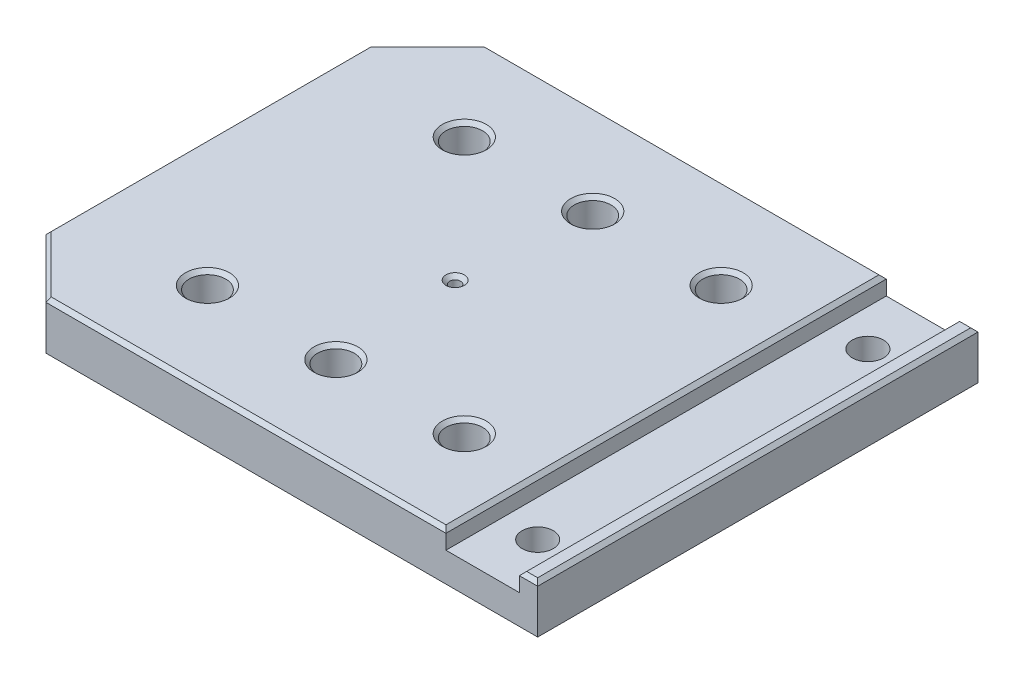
from build123d import *

# Parameters (mm, degrees)
SKETCH1_W           = 150
SKETCH1_H           = 120
BOSS_EXTRUDE1_DEPTH = 14
SKETCH2_W           = 20
SKETCH2_H           = 120
CUT_EXTRUDE1_DEPTH  = 5
SKETCH3_R           = 4.25
CUT_EXTRUDE2_DEPTH  = 163.160414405
CHAMFER1_SIZE       = 16
CUT_EXTRUDE3_DEPTH  = 5
CUT_EXTRUDE4_REACH  = 163.805
SKETCH5_R           = 5
SKETCH7_W           = 85
SKETCH7_H           = 30
CUT_EXTRUDE6_DEPTH  = 3
FILLET1_R           = 5
SKETCH8_R           = 1.5
CUT_EXTRUDE7_DEPTH  = 162.928996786
CHAMFER2_SIZE       = 1


with BuildPart() as part:
    # Sketch1 → Boss-Extrude1 (new body)
    with BuildSketch(Plane(origin=(0, 0, 0), x_dir=(1, 0, 0), z_dir=(0, 1, 0))):
        with Locations((-75, 0)):
            Rectangle(SKETCH1_W, SKETCH1_H)
    extrude(amount=BOSS_EXTRUDE1_DEPTH)

    # Sketch2 → Cut-Extrude1 (cut)
    with BuildSketch(Plane(origin=(0, 14, 0), x_dir=(1, 0, 0), z_dir=(0, 1, 0))):
        with Locations((-15, 0)):
            Rectangle(SKETCH2_W, SKETCH2_H)
    extrude(amount=-CUT_EXTRUDE1_DEPTH, mode=Mode.SUBTRACT)

    # Sketch3 → Cut-Extrude2 (cut, through all)
    with BuildSketch(Plane.XZ):
        with Locations(Location((-15, 45, 0), (0, 0, 270))):
            Circle(SKETCH3_R)
        with Locations(Location((-15, -45, 0), (0, 0, 270))):
            Circle(SKETCH3_R)
    extrude(amount=-CUT_EXTRUDE2_DEPTH, mode=Mode.SUBTRACT)

    # Chamfer1
    chamfer1_edges = [part.edges().sort_by_distance(p)[0] for p in [
        (-150, 7, -60),
        (-150, 7, 60),
    ]]
    chamfer(chamfer1_edges, length=CHAMFER1_SIZE)

    # Sketch4 → Cut-Extrude3 (cut)
    with BuildSketch(Plane.XZ):
        with BuildLine():
            Line((-115, 43), (-45, 43))
            ThreePointArc((-45, 43), (-37, 35), (-45, 27))
            Line((-45, 27), (-115, 27))
            ThreePointArc((-115, 27), (-123, 35), (-115, 43))
        make_face()
    cut_extrude3 = extrude(amount=-CUT_EXTRUDE3_DEPTH, mode=Mode.SUBTRACT)

    # Sketch5 → Cut-Extrude4 (cut, up to next)
    with BuildSketch(Plane.XZ.offset(-5), mode=Mode.PRIVATE) as cut_extrude4_sk1:
        with Locations(Location((-115, 35, 0), (0, 0, 270))):
            Circle(SKETCH5_R)
    cut_extrude4_tool1 = extrude(cut_extrude4_sk1.sketch, amount=-CUT_EXTRUDE4_REACH, mode=Mode.PRIVATE) & part.part
    # Sketch5 → Cut-Extrude4 (cut, up to next)
    with BuildSketch(Plane.XZ.offset(-5), mode=Mode.PRIVATE) as cut_extrude4_sk2:
        with Locations(Location((-45, 35, 0), (0, 0, 270))):
            Circle(SKETCH5_R)
    cut_extrude4_tool2 = extrude(cut_extrude4_sk2.sketch, amount=-CUT_EXTRUDE4_REACH, mode=Mode.PRIVATE) & part.part
    # Sketch5 → Cut-Extrude4 (cut, up to next)
    with BuildSketch(Plane.XZ.offset(-5), mode=Mode.PRIVATE) as cut_extrude4_sk3:
        with Locations(Location((-80, 35, 0), (0, 0, 270))):
            Circle(SKETCH5_R)
    cut_extrude4_tool3 = extrude(cut_extrude4_sk3.sketch, amount=-CUT_EXTRUDE4_REACH, mode=Mode.PRIVATE) & part.part
    cut_extrude4_1 = cut_extrude4_tool1.solids().sort_by_distance((-115, 5, 35))[0]
    add(cut_extrude4_1, mode=Mode.SUBTRACT)
    cut_extrude4_2 = cut_extrude4_tool2.solids().sort_by_distance((-45, 5, 35))[0]
    add(cut_extrude4_2, mode=Mode.SUBTRACT)
    cut_extrude4_3 = cut_extrude4_tool3.solids().sort_by_distance((-80, 5, 35))[0]
    add(cut_extrude4_3, mode=Mode.SUBTRACT)
    cut_extrude4 = cut_extrude4_1 + cut_extrude4_2 + cut_extrude4_3  # Cut-Extrude4 as one shape, for the pattern or mirror that repeats it

    # Mirror1: Cut-Extrude3, Cut-Extrude4 across plane
    add(cut_extrude3.mirror(Plane.XY), mode=Mode.SUBTRACT)
    add(cut_extrude4.mirror(Plane.XY), mode=Mode.SUBTRACT)

    # Sketch7 → Cut-Extrude6 (cut)
    with BuildSketch(Plane.XZ):
        with Locations((-82.5, 0)):
            Rectangle(SKETCH7_W, SKETCH7_H)
    extrude(amount=-CUT_EXTRUDE6_DEPTH, mode=Mode.SUBTRACT)

    # Fillet1
    fillet1_edges = [part.edges().sort_by_distance(p)[0] for p in [
        (-40, 1.5, 15),
        (-40, 1.5, -15),
        (-125, 1.5, -15),
        (-125, 1.5, 15),
    ]]
    fillet(fillet1_edges, radius=FILLET1_R)

    # Sketch8 → Cut-Extrude7 (cut, through all)
    with BuildSketch(Plane.XZ.offset(-3)):
        with Locations(Location((-82.5, 0, 0), (0, 0, 270))):
            Circle(SKETCH8_R)
    extrude(amount=-CUT_EXTRUDE7_DEPTH, mode=Mode.SUBTRACT)

    # Chamfer2
    chamfer2_edges = [part.edges().sort_by_distance(p)[0] for p in [
        (0, 14, 0),
        (-150, 0, 0),
        (-150, 14, 0),
        (-67, 0, 60),
        (-142, 0, 52),
        (-142, 0, -52),
        (-79.5, 14, 60),
        (-142, 14, 52),
        (-142, 14, -52),
        (-123, 0, 35),
        (-80, 0, 27),
        (-37, 0, 35),
        (-80, 0, 43),
        (-115, 14, 40),
        (-45, 14, 40),
        (-80, 14, 40),
        (-123, 0, -35),
        (-80, 0, -27),
        (-37, 0, -35),
        (-80, 0, -43),
        (-115, 14, -40),
        (-45, 14, -40),
        (-80, 14, -40),
        (-2.5, 14, -60),
        (-82.5, 0, -15),
        (-125, 0, 0),
        (-40, 0, 0),
        (-82.5, 0, 15),
        (-123.535533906, 0, -13.535533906),
        (-41.464466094, 0, -13.535533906),
        (-41.464466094, 0, 13.535533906),
        (-123.535533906, 0, 13.535533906),
        (-82.5, 14, 1.5),
        (-2.5, 14, 60),
        (-79.5, 14, -60),
        (-25, 14, 0),
        (-5, 14, 0),
        (-15, 0, 49.25),
        (-15, 0, -40.75),
        (-67, 0, -60),
        (0, 0, 0),
    ]]
    chamfer(chamfer2_edges, length=CHAMFER2_SIZE)


solid = part.part
